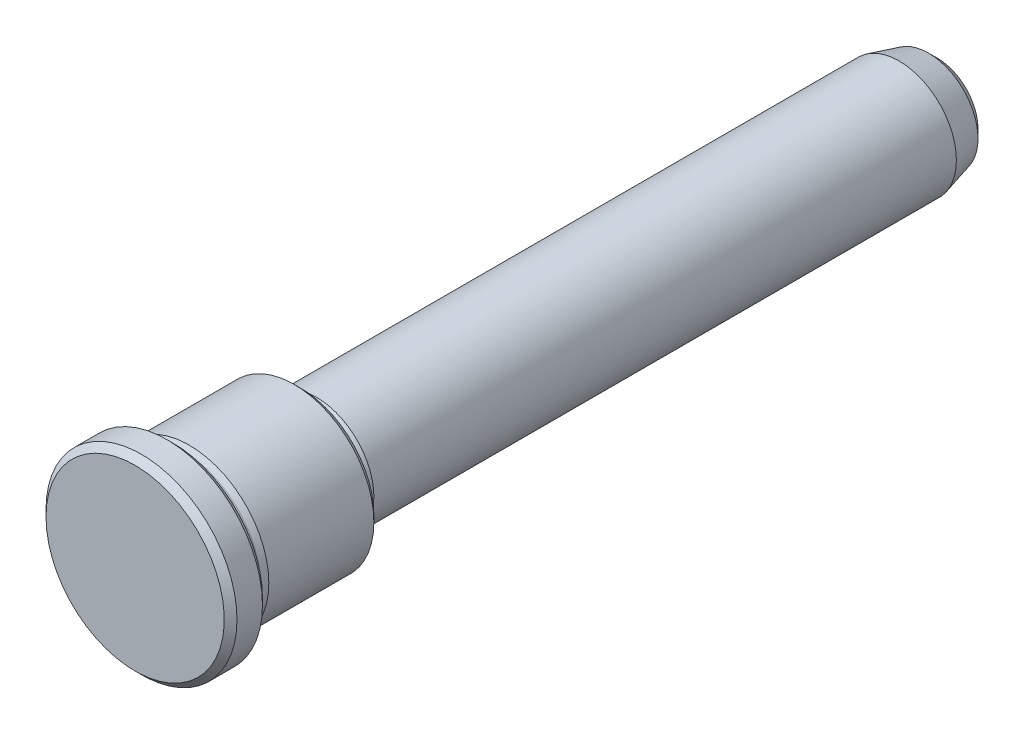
ISO-10303-21;
HEADER;
FILE_DESCRIPTION(('STEP AP214'),'2;1');
FILE_NAME('part.step','',(''),(''),'','','');
FILE_SCHEMA(('AUTOMOTIVE_DESIGN { 1 0 10303 214 1 1 1 1 }'));
ENDSEC;
DATA;
#1=APPLICATION_CONTEXT('core data for automotive mechanical design processes');
#2=APPLICATION_PROTOCOL_DEFINITION('international standard','automotive_design',2000,#1);
#3=PRODUCT_CONTEXT('',#1,'mechanical');
#4=PRODUCT('Part','Part','',(#3));
#5=PRODUCT_RELATED_PRODUCT_CATEGORY('part','',(#4));
#6=PRODUCT_DEFINITION_FORMATION('','',#4);
#7=PRODUCT_DEFINITION_CONTEXT('part definition',#1,'design');
#8=PRODUCT_DEFINITION('design','',#6,#7);
#9=PRODUCT_DEFINITION_SHAPE('','',#8);
#10=(LENGTH_UNIT() NAMED_UNIT(*) SI_UNIT(.MILLI.,.METRE.));
#11=(NAMED_UNIT(*) PLANE_ANGLE_UNIT() SI_UNIT($,.RADIAN.));
#12=(NAMED_UNIT(*) SI_UNIT($,.STERADIAN.) SOLID_ANGLE_UNIT());
#13=UNCERTAINTY_MEASURE_WITH_UNIT(LENGTH_MEASURE(1.E-05),#10,'distance_accuracy_value','');
#14=(GEOMETRIC_REPRESENTATION_CONTEXT(3) GLOBAL_UNCERTAINTY_ASSIGNED_CONTEXT((#13)) GLOBAL_UNIT_ASSIGNED_CONTEXT((#10,
#11,#12)) REPRESENTATION_CONTEXT('',''));
#15=CARTESIAN_POINT('',(0.,0.,0.));
#16=DIRECTION('',(0.,0.,1.));
#17=DIRECTION('',(1.,0.,0.));
#18=AXIS2_PLACEMENT_3D('',#15,#16,#17);
#19=CARTESIAN_POINT('',(0.,0.,0.));
#20=DIRECTION('',(0.,0.,-1.));
#21=DIRECTION('',(-1.,0.,0.));
#22=AXIS2_PLACEMENT_3D('',#19,#20,#21);
#23=PLANE('',#22);
#24=CARTESIAN_POINT('',(0.,0.,0.));
#25=DIRECTION('',(0.,0.,-1.));
#26=DIRECTION('',(-1.,0.,0.));
#27=AXIS2_PLACEMENT_3D('',#24,#25,#26);
#28=CIRCLE('',#27,14.);
#29=CARTESIAN_POINT('',(-14.,0.,0.));
#30=VERTEX_POINT('',#29);
#31=EDGE_CURVE('E9',#30,#30,#28,.F.);
#32=ORIENTED_EDGE('',*,*,#31,.T.);
#33=EDGE_LOOP('',(#32));
#34=FACE_BOUND('',#33,.T.);
#35=ADVANCED_FACE('F14',(#34),#23,.F.);
#36=CARTESIAN_POINT('',(0.,0.,0.));
#37=DIRECTION('',(0.,0.,1.));
#38=DIRECTION('',(1.,0.,0.));
#39=AXIS2_PLACEMENT_3D('',#36,#37,#38);
#40=CYLINDRICAL_SURFACE('',#39,15.);
#41=CARTESIAN_POINT('',(0.,0.,-5.));
#42=DIRECTION('',(0.,0.,1.));
#43=DIRECTION('',(1.,0.,0.));
#44=AXIS2_PLACEMENT_3D('',#41,#42,#43);
#45=CIRCLE('',#44,15.);
#46=CARTESIAN_POINT('',(15.,0.,-5.));
#47=VERTEX_POINT('',#46);
#48=EDGE_CURVE('E25',#47,#47,#45,.T.);
#49=ORIENTED_EDGE('',*,*,#48,.T.);
#50=EDGE_LOOP('',(#49));
#51=FACE_BOUND('',#50,.T.);
#52=CARTESIAN_POINT('',(0.,0.,-1.));
#53=DIRECTION('',(0.,0.,-1.));
#54=DIRECTION('',(-1.,0.,0.));
#55=AXIS2_PLACEMENT_3D('',#52,#53,#54);
#56=CIRCLE('',#55,15.);
#57=CARTESIAN_POINT('',(-15.,0.,-1.));
#58=VERTEX_POINT('',#57);
#59=EDGE_CURVE('E29',#58,#58,#56,.T.);
#60=ORIENTED_EDGE('',*,*,#59,.T.);
#61=EDGE_LOOP('',(#60));
#62=FACE_BOUND('',#61,.T.);
#63=ADVANCED_FACE('F100',(#51,#62),#40,.T.);
#64=CARTESIAN_POINT('',(0.,15.,-6.));
#65=DIRECTION('',(0.,0.,1.));
#66=DIRECTION('',(1.,0.,0.));
#67=AXIS2_PLACEMENT_3D('',#64,#65,#66);
#68=PLANE('',#67);
#69=CARTESIAN_POINT('',(0.,0.,-6.));
#70=DIRECTION('',(0.,0.,1.));
#71=DIRECTION('',(1.,0.,0.));
#72=AXIS2_PLACEMENT_3D('',#69,#70,#71);
#73=CIRCLE('',#72,14.);
#74=CARTESIAN_POINT('',(14.,0.,-6.));
#75=VERTEX_POINT('',#74);
#76=EDGE_CURVE('E21',#75,#75,#73,.F.);
#77=ORIENTED_EDGE('',*,*,#76,.T.);
#78=EDGE_LOOP('',(#77));
#79=FACE_BOUND('',#78,.T.);
#80=CARTESIAN_POINT('',(0.,0.,-6.));
#81=DIRECTION('',(0.,0.,1.));
#82=DIRECTION('',(1.,0.,0.));
#83=AXIS2_PLACEMENT_3D('',#80,#81,#82);
#84=CIRCLE('',#83,13.);
#85=CARTESIAN_POINT('',(13.,0.,-6.));
#86=VERTEX_POINT('',#85);
#87=EDGE_CURVE('E46',#86,#86,#84,.T.);
#88=ORIENTED_EDGE('',*,*,#87,.T.);
#89=EDGE_LOOP('',(#88));
#90=FACE_BOUND('',#89,.T.);
#91=ADVANCED_FACE('F106',(#79,#90),#68,.F.);
#92=CARTESIAN_POINT('',(0.,0.,-6.8));
#93=DIRECTION('',(0.,0.,1.));
#94=DIRECTION('',(1.,0.,0.));
#95=AXIS2_PLACEMENT_3D('',#92,#93,#94);
#96=TOROIDAL_SURFACE('',#95,13.,0.8);
#97=ORIENTED_EDGE('',*,*,#87,.F.);
#98=EDGE_LOOP('',(#97));
#99=FACE_BOUND('',#98,.T.);
#100=CARTESIAN_POINT('',(0.,0.,-6.8));
#101=DIRECTION('',(0.,0.,1.));
#102=DIRECTION('',(1.,0.,0.));
#103=AXIS2_PLACEMENT_3D('',#100,#101,#102);
#104=CIRCLE('',#103,12.2);
#105=CARTESIAN_POINT('',(12.2,0.,-6.8));
#106=VERTEX_POINT('',#105);
#107=EDGE_CURVE('E49',#106,#106,#104,.T.);
#108=ORIENTED_EDGE('',*,*,#107,.T.);
#109=EDGE_LOOP('',(#108));
#110=FACE_BOUND('',#109,.T.);
#111=ADVANCED_FACE('F176',(#99,#110),#96,.F.);
#112=CARTESIAN_POINT('',(0.,0.,0.));
#113=DIRECTION('',(0.,0.,1.));
#114=DIRECTION('',(1.,0.,0.));
#115=AXIS2_PLACEMENT_3D('',#112,#113,#114);
#116=CYLINDRICAL_SURFACE('',#115,12.2);
#117=ORIENTED_EDGE('',*,*,#107,.F.);
#118=EDGE_LOOP('',(#117));
#119=FACE_BOUND('',#118,.T.);
#120=CARTESIAN_POINT('',(0.,0.,-7.27506275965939));
#121=DIRECTION('',(0.,0.,1.));
#122=DIRECTION('',(1.,0.,0.));
#123=AXIS2_PLACEMENT_3D('',#120,#121,#122);
#124=CIRCLE('',#123,12.2);
#125=CARTESIAN_POINT('',(12.2,0.,-7.27506275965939));
#126=VERTEX_POINT('',#125);
#127=EDGE_CURVE('E52',#126,#126,#124,.T.);
#128=ORIENTED_EDGE('',*,*,#127,.T.);
#129=EDGE_LOOP('',(#128));
#130=FACE_BOUND('',#129,.T.);
#131=ADVANCED_FACE('F232',(#119,#130),#116,.T.);
#132=CARTESIAN_POINT('',(0.,0.,-7.27506275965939));
#133=DIRECTION('',(0.,0.,1.));
#134=DIRECTION('',(1.,0.,0.));
#135=AXIS2_PLACEMENT_3D('',#132,#133,#134);
#136=TOROIDAL_SURFACE('',#135,13.,0.8);
#137=ORIENTED_EDGE('',*,*,#127,.F.);
#138=EDGE_LOOP('',(#137));
#139=FACE_BOUND('',#138,.T.);
#140=CARTESIAN_POINT('',(0.,0.,-7.4821179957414));
#141=DIRECTION('',(0.,0.,1.));
#142=DIRECTION('',(1.,0.,0.));
#143=AXIS2_PLACEMENT_3D('',#140,#141,#142);
#144=CIRCLE('',#143,12.2272593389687);
#145=CARTESIAN_POINT('',(12.2272593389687,0.,-7.4821179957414));
#146=VERTEX_POINT('',#145);
#147=EDGE_CURVE('E55',#146,#146,#144,.T.);
#148=ORIENTED_EDGE('',*,*,#147,.T.);
#149=EDGE_LOOP('',(#148));
#150=FACE_BOUND('',#149,.T.);
#151=ADVANCED_FACE('F222',(#139,#150),#136,.F.);
#152=CARTESIAN_POINT('',(0.,0.,-8.5));
#153=DIRECTION('',(0.,0.,-1.));
#154=DIRECTION('',(-1.,0.,0.));
#155=AXIS2_PLACEMENT_3D('',#152,#153,#154);
#156=CONICAL_SURFACE('',#155,12.5,0.261799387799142);
#157=ORIENTED_EDGE('',*,*,#147,.F.);
#158=EDGE_LOOP('',(#157));
#159=FACE_BOUND('',#158,.T.);
#160=CARTESIAN_POINT('',(0.,0.,-8.5));
#161=DIRECTION('',(0.,0.,1.));
#162=DIRECTION('',(1.,0.,0.));
#163=AXIS2_PLACEMENT_3D('',#160,#161,#162);
#164=CIRCLE('',#163,12.5);
#165=CARTESIAN_POINT('',(12.5,0.,-8.5));
#166=VERTEX_POINT('',#165);
#167=EDGE_CURVE('E58',#166,#166,#164,.T.);
#168=ORIENTED_EDGE('',*,*,#167,.T.);
#169=EDGE_LOOP('',(#168));
#170=FACE_BOUND('',#169,.T.);
#171=ADVANCED_FACE('F164',(#159,#170),#156,.T.);
#172=CARTESIAN_POINT('',(0.,0.,0.));
#173=DIRECTION('',(0.,0.,1.));
#174=DIRECTION('',(1.,0.,0.));
#175=AXIS2_PLACEMENT_3D('',#172,#173,#174);
#176=CYLINDRICAL_SURFACE('',#175,12.5);
#177=CARTESIAN_POINT('',(0.,0.,-25.));
#178=DIRECTION('',(0.,0.,1.));
#179=DIRECTION('',(1.,0.,0.));
#180=AXIS2_PLACEMENT_3D('',#177,#178,#179);
#181=CIRCLE('',#180,12.5);
#182=CARTESIAN_POINT('',(12.5,0.,-25.));
#183=VERTEX_POINT('',#182);
#184=EDGE_CURVE('E37',#183,#183,#181,.T.);
#185=ORIENTED_EDGE('',*,*,#184,.T.);
#186=EDGE_LOOP('',(#185));
#187=FACE_BOUND('',#186,.T.);
#188=ORIENTED_EDGE('',*,*,#167,.F.);
#189=EDGE_LOOP('',(#188));
#190=FACE_BOUND('',#189,.T.);
#191=ADVANCED_FACE('F152',(#187,#190),#176,.T.);
#192=CARTESIAN_POINT('',(0.,12.5,-26.));
#193=DIRECTION('',(0.,0.,1.));
#194=DIRECTION('',(1.,0.,0.));
#195=AXIS2_PLACEMENT_3D('',#192,#193,#194);
#196=PLANE('',#195);
#197=CARTESIAN_POINT('',(0.,0.,-26.));
#198=DIRECTION('',(0.,0.,1.));
#199=DIRECTION('',(1.,0.,0.));
#200=AXIS2_PLACEMENT_3D('',#197,#198,#199);
#201=CIRCLE('',#200,11.5);
#202=CARTESIAN_POINT('',(11.5,0.,-26.));
#203=VERTEX_POINT('',#202);
#204=EDGE_CURVE('E34',#203,#203,#201,.F.);
#205=ORIENTED_EDGE('',*,*,#204,.T.);
#206=EDGE_LOOP('',(#205));
#207=FACE_BOUND('',#206,.T.);
#208=CARTESIAN_POINT('',(0.,0.,-26.));
#209=DIRECTION('',(0.,0.,1.));
#210=DIRECTION('',(1.,0.,0.));
#211=AXIS2_PLACEMENT_3D('',#208,#209,#210);
#212=CIRCLE('',#211,9.5);
#213=CARTESIAN_POINT('',(9.5,0.,-26.));
#214=VERTEX_POINT('',#213);
#215=EDGE_CURVE('E61',#214,#214,#212,.T.);
#216=ORIENTED_EDGE('',*,*,#215,.T.);
#217=EDGE_LOOP('',(#216));
#218=FACE_BOUND('',#217,.T.);
#219=ADVANCED_FACE('F146',(#207,#218),#196,.F.);
#220=CARTESIAN_POINT('',(0.,0.,-26.8));
#221=DIRECTION('',(0.,0.,1.));
#222=DIRECTION('',(1.,0.,0.));
#223=AXIS2_PLACEMENT_3D('',#220,#221,#222);
#224=TOROIDAL_SURFACE('',#223,9.5,0.8);
#225=ORIENTED_EDGE('',*,*,#215,.F.);
#226=EDGE_LOOP('',(#225));
#227=FACE_BOUND('',#226,.T.);
#228=CARTESIAN_POINT('',(0.,0.,-26.8));
#229=DIRECTION('',(0.,0.,1.));
#230=DIRECTION('',(1.,0.,0.));
#231=AXIS2_PLACEMENT_3D('',#228,#229,#230);
#232=CIRCLE('',#231,8.7);
#233=CARTESIAN_POINT('',(8.7,0.,-26.8));
#234=VERTEX_POINT('',#233);
#235=EDGE_CURVE('E64',#234,#234,#232,.T.);
#236=ORIENTED_EDGE('',*,*,#235,.T.);
#237=EDGE_LOOP('',(#236));
#238=FACE_BOUND('',#237,.T.);
#239=ADVANCED_FACE('F151',(#227,#238),#224,.F.);
#240=CARTESIAN_POINT('',(0.,0.,0.));
#241=DIRECTION('',(0.,0.,1.));
#242=DIRECTION('',(1.,0.,0.));
#243=AXIS2_PLACEMENT_3D('',#240,#241,#242);
#244=CYLINDRICAL_SURFACE('',#243,8.7);
#245=ORIENTED_EDGE('',*,*,#235,.F.);
#246=EDGE_LOOP('',(#245));
#247=FACE_BOUND('',#246,.T.);
#248=CARTESIAN_POINT('',(0.,0.,-27.2750627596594));
#249=DIRECTION('',(0.,0.,1.));
#250=DIRECTION('',(1.,0.,0.));
#251=AXIS2_PLACEMENT_3D('',#248,#249,#250);
#252=CIRCLE('',#251,8.7);
#253=CARTESIAN_POINT('',(8.7,0.,-27.2750627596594));
#254=VERTEX_POINT('',#253);
#255=EDGE_CURVE('E67',#254,#254,#252,.T.);
#256=ORIENTED_EDGE('',*,*,#255,.T.);
#257=EDGE_LOOP('',(#256));
#258=FACE_BOUND('',#257,.T.);
#259=ADVANCED_FACE('F198',(#247,#258),#244,.T.);
#260=CARTESIAN_POINT('',(0.,0.,-27.2750627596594));
#261=DIRECTION('',(0.,0.,1.));
#262=DIRECTION('',(1.,0.,0.));
#263=AXIS2_PLACEMENT_3D('',#260,#261,#262);
#264=TOROIDAL_SURFACE('',#263,9.5,0.8);
#265=ORIENTED_EDGE('',*,*,#255,.F.);
#266=EDGE_LOOP('',(#265));
#267=FACE_BOUND('',#266,.T.);
#268=CARTESIAN_POINT('',(0.,0.,-27.4821179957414));
#269=DIRECTION('',(0.,0.,1.));
#270=DIRECTION('',(1.,0.,0.));
#271=AXIS2_PLACEMENT_3D('',#268,#269,#270);
#272=CIRCLE('',#271,8.72725933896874);
#273=CARTESIAN_POINT('',(8.72725933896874,0.,-27.4821179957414));
#274=VERTEX_POINT('',#273);
#275=EDGE_CURVE('E70',#274,#274,#272,.T.);
#276=ORIENTED_EDGE('',*,*,#275,.T.);
#277=EDGE_LOOP('',(#276));
#278=FACE_BOUND('',#277,.T.);
#279=ADVANCED_FACE('F187',(#267,#278),#264,.F.);
#280=CARTESIAN_POINT('',(0.,0.,-28.5));
#281=DIRECTION('',(0.,0.,-1.));
#282=DIRECTION('',(-1.,0.,0.));
#283=AXIS2_PLACEMENT_3D('',#280,#281,#282);
#284=CONICAL_SURFACE('',#283,9.,0.261799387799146);
#285=ORIENTED_EDGE('',*,*,#275,.F.);
#286=EDGE_LOOP('',(#285));
#287=FACE_BOUND('',#286,.T.);
#288=CARTESIAN_POINT('',(0.,0.,-28.5));
#289=DIRECTION('',(0.,0.,1.));
#290=DIRECTION('',(1.,0.,0.));
#291=AXIS2_PLACEMENT_3D('',#288,#289,#290);
#292=CIRCLE('',#291,9.);
#293=CARTESIAN_POINT('',(9.,0.,-28.5));
#294=VERTEX_POINT('',#293);
#295=EDGE_CURVE('E73',#294,#294,#292,.T.);
#296=ORIENTED_EDGE('',*,*,#295,.T.);
#297=EDGE_LOOP('',(#296));
#298=FACE_BOUND('',#297,.T.);
#299=ADVANCED_FACE('F96',(#287,#298),#284,.T.);
#300=CARTESIAN_POINT('',(0.,0.,0.));
#301=DIRECTION('',(0.,0.,1.));
#302=DIRECTION('',(1.,0.,0.));
#303=AXIS2_PLACEMENT_3D('',#300,#301,#302);
#304=CYLINDRICAL_SURFACE('',#303,9.);
#305=ORIENTED_EDGE('',*,*,#295,.F.);
#306=EDGE_LOOP('',(#305));
#307=FACE_BOUND('',#306,.T.);
#308=CARTESIAN_POINT('',(0.,0.,-120.));
#309=DIRECTION('',(0.,0.,1.));
#310=DIRECTION('',(1.,0.,0.));
#311=AXIS2_PLACEMENT_3D('',#308,#309,#310);
#312=CIRCLE('',#311,9.);
#313=CARTESIAN_POINT('',(9.,0.,-120.));
#314=VERTEX_POINT('',#313);
#315=EDGE_CURVE('E76',#314,#314,#312,.T.);
#316=ORIENTED_EDGE('',*,*,#315,.T.);
#317=EDGE_LOOP('',(#316));
#318=FACE_BOUND('',#317,.T.);
#319=ADVANCED_FACE('F80',(#307,#318),#304,.T.);
#320=CARTESIAN_POINT('',(0.,0.,-126.));
#321=DIRECTION('',(0.,0.,1.));
#322=DIRECTION('',(1.,0.,0.));
#323=AXIS2_PLACEMENT_3D('',#320,#321,#322);
#324=CONICAL_SURFACE('',#323,7.39230484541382,0.261799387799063);
#325=CARTESIAN_POINT('',(0.,0.,-124.633974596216));
#326=DIRECTION('',(0.,0.,-1.));
#327=DIRECTION('',(-1.,0.,0.));
#328=AXIS2_PLACEMENT_3D('',#325,#326,#327);
#329=CIRCLE('',#328,7.7583302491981);
#330=CARTESIAN_POINT('',(-7.7583302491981,0.,-124.633974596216));
#331=VERTEX_POINT('',#330);
#332=EDGE_CURVE('E43',#331,#331,#329,.F.);
#333=ORIENTED_EDGE('',*,*,#332,.T.);
#334=EDGE_LOOP('',(#333));
#335=FACE_BOUND('',#334,.T.);
#336=ORIENTED_EDGE('',*,*,#315,.F.);
#337=EDGE_LOOP('',(#336));
#338=FACE_BOUND('',#337,.T.);
#339=ADVANCED_FACE('F82',(#335,#338),#324,.T.);
#340=CARTESIAN_POINT('',(0.,7.39230484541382,-126.));
#341=DIRECTION('',(0.,0.,1.));
#342=DIRECTION('',(1.,0.,0.));
#343=AXIS2_PLACEMENT_3D('',#340,#341,#342);
#344=PLANE('',#343);
#345=CARTESIAN_POINT('',(0.,0.,-126.));
#346=DIRECTION('',(0.,0.,1.));
#347=DIRECTION('',(1.,0.,0.));
#348=AXIS2_PLACEMENT_3D('',#345,#346,#347);
#349=CIRCLE('',#348,6.3923048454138);
#350=CARTESIAN_POINT('',(6.3923048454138,0.,-126.));
#351=VERTEX_POINT('',#350);
#352=EDGE_CURVE('E40',#351,#351,#349,.F.);
#353=ORIENTED_EDGE('',*,*,#352,.T.);
#354=EDGE_LOOP('',(#353));
#355=FACE_BOUND('',#354,.T.);
#356=ADVANCED_FACE('F84',(#355),#344,.F.);
#357=CARTESIAN_POINT('',(0.,0.,-124.633974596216));
#358=DIRECTION('',(0.,0.,1.));
#359=DIRECTION('',(1.,0.,0.));
#360=AXIS2_PLACEMENT_3D('',#357,#358,#359);
#361=CONICAL_SURFACE('',#360,7.7583302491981,0.785398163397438);
#362=ORIENTED_EDGE('',*,*,#352,.F.);
#363=EDGE_LOOP('',(#362));
#364=FACE_BOUND('',#363,.T.);
#365=ORIENTED_EDGE('',*,*,#332,.F.);
#366=EDGE_LOOP('',(#365));
#367=FACE_BOUND('',#366,.T.);
#368=ADVANCED_FACE('F93',(#364,#367),#361,.T.);
#369=CARTESIAN_POINT('',(0.,0.,-25.));
#370=DIRECTION('',(0.,0.,1.));
#371=DIRECTION('',(1.,0.,0.));
#372=AXIS2_PLACEMENT_3D('',#369,#370,#371);
#373=CONICAL_SURFACE('',#372,12.5,0.785398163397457);
#374=ORIENTED_EDGE('',*,*,#204,.F.);
#375=EDGE_LOOP('',(#374));
#376=FACE_BOUND('',#375,.T.);
#377=ORIENTED_EDGE('',*,*,#184,.F.);
#378=EDGE_LOOP('',(#377));
#379=FACE_BOUND('',#378,.T.);
#380=ADVANCED_FACE('F113',(#376,#379),#373,.T.);
#381=CARTESIAN_POINT('',(0.,0.,-5.));
#382=DIRECTION('',(0.,0.,1.));
#383=DIRECTION('',(1.,0.,0.));
#384=AXIS2_PLACEMENT_3D('',#381,#382,#383);
#385=CONICAL_SURFACE('',#384,15.,0.785398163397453);
#386=ORIENTED_EDGE('',*,*,#76,.F.);
#387=EDGE_LOOP('',(#386));
#388=FACE_BOUND('',#387,.T.);
#389=ORIENTED_EDGE('',*,*,#48,.F.);
#390=EDGE_LOOP('',(#389));
#391=FACE_BOUND('',#390,.T.);
#392=ADVANCED_FACE('F116',(#388,#391),#385,.T.);
#393=CARTESIAN_POINT('',(0.,0.,0.));
#394=DIRECTION('',(0.,0.,-1.));
#395=DIRECTION('',(-1.,0.,0.));
#396=AXIS2_PLACEMENT_3D('',#393,#394,#395);
#397=CONICAL_SURFACE('',#396,14.,0.785398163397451);
#398=ORIENTED_EDGE('',*,*,#59,.F.);
#399=EDGE_LOOP('',(#398));
#400=FACE_BOUND('',#399,.T.);
#401=ORIENTED_EDGE('',*,*,#31,.F.);
#402=EDGE_LOOP('',(#401));
#403=FACE_BOUND('',#402,.T.);
#404=ADVANCED_FACE('F16',(#400,#403),#397,.T.);
#405=CLOSED_SHELL('',(#35,#63,#91,#111,#131,#151,#171,#191,#219,#239,#259,#279,#299,#319,#339,
#356,#368,#380,#392,#404));
#406=MANIFOLD_SOLID_BREP('B1',#405);
#407=ADVANCED_BREP_SHAPE_REPRESENTATION('',(#18,#406),#14);
#408=SHAPE_DEFINITION_REPRESENTATION(#9,#407);
ENDSEC;
END-ISO-10303-21;
